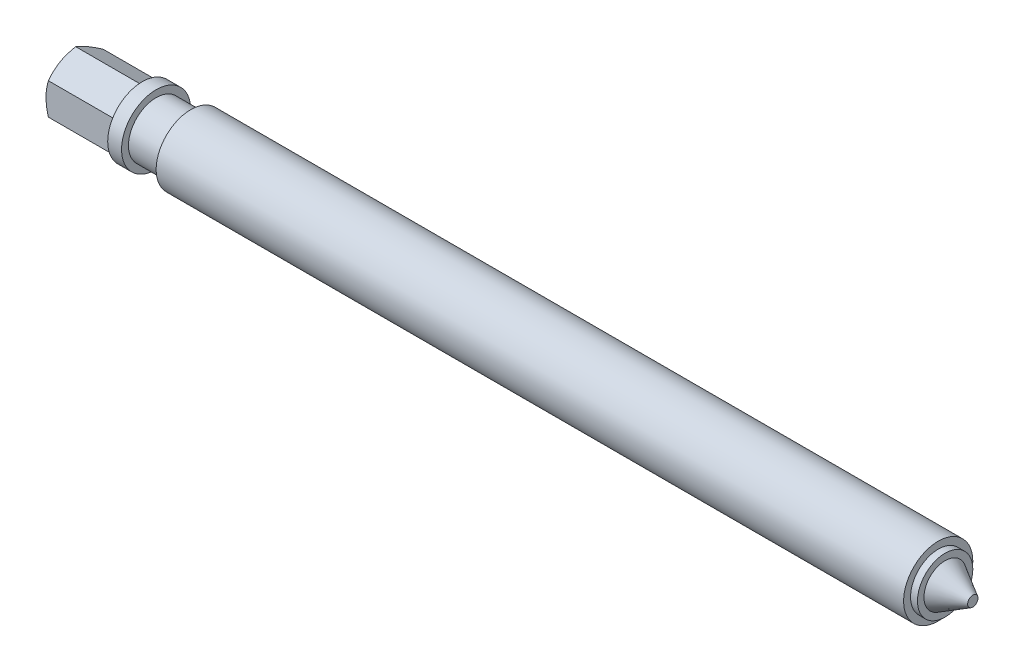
from build123d import *

# Parameters (mm, degrees)
SKIZZE2_OUTSIDE_W               = 38.154
SKIZZE2_OUTSIDE_H               = 38.154
SCHNITT_LINEAR_AUSTRAGEN1_DEPTH = 10
SKIZZE3_W                       = 5
SKIZZE3_H                       = 1


with BuildPart() as part:
    # Skizze1 → Rotation1 (revolve)
    with BuildSketch(Plane.XY, mode=Mode.PRIVATE) as rotation1_sk:
        Polygon((0, 0), (0, 0.75), (-4, 3.059401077), (-4, 4), (-5, 4), (-5, 5), (-130, 5), (-130, 0), align=None)
    revolve(rotation1_sk.sketch.rotate(Axis((0, 0, 0), (-1, 0, 0)), 90), axis=Axis((0, 0, 0), (-1, 0, 0)))

    # Skizze2 outside → Schnitt-Linear austragen1 (cut)
    with BuildSketch(Plane.ZY.offset(130)):
        Rectangle(SKIZZE2_OUTSIDE_W, SKIZZE2_OUTSIDE_H)
        Polygon((3.95, 2.280533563), (0, 4.561067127), (-3.95, 2.280533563), (-3.95, -2.280533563), (0, -4.561067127), (3.95, -2.280533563), align=None, mode=Mode.SUBTRACT)
    extrude(amount=-SCHNITT_LINEAR_AUSTRAGEN1_DEPTH, mode=Mode.SUBTRACT)

    # Skizze3 → Schnitt-Rotation1 (revolve, cut)
    with BuildSketch(Plane.XY):
        with Locations((-115.5, 4.5)):
            Rectangle(SKIZZE3_W, SKIZZE3_H)
    revolve(axis=Axis((0, 0, 0), (-1, 0, 0)), mode=Mode.SUBTRACT)

    # Skizze4 → Schnitt-Rotation2 (revolve, cut)
    with BuildSketch(Plane.XY):
        Polygon((-130, 3.9), (-129.618332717, 4.561067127), (-130, 4.561067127), align=None)
    revolve(axis=Axis((0, 0, 0), (-1, 0, 0)), mode=Mode.SUBTRACT)


solid = part.part
